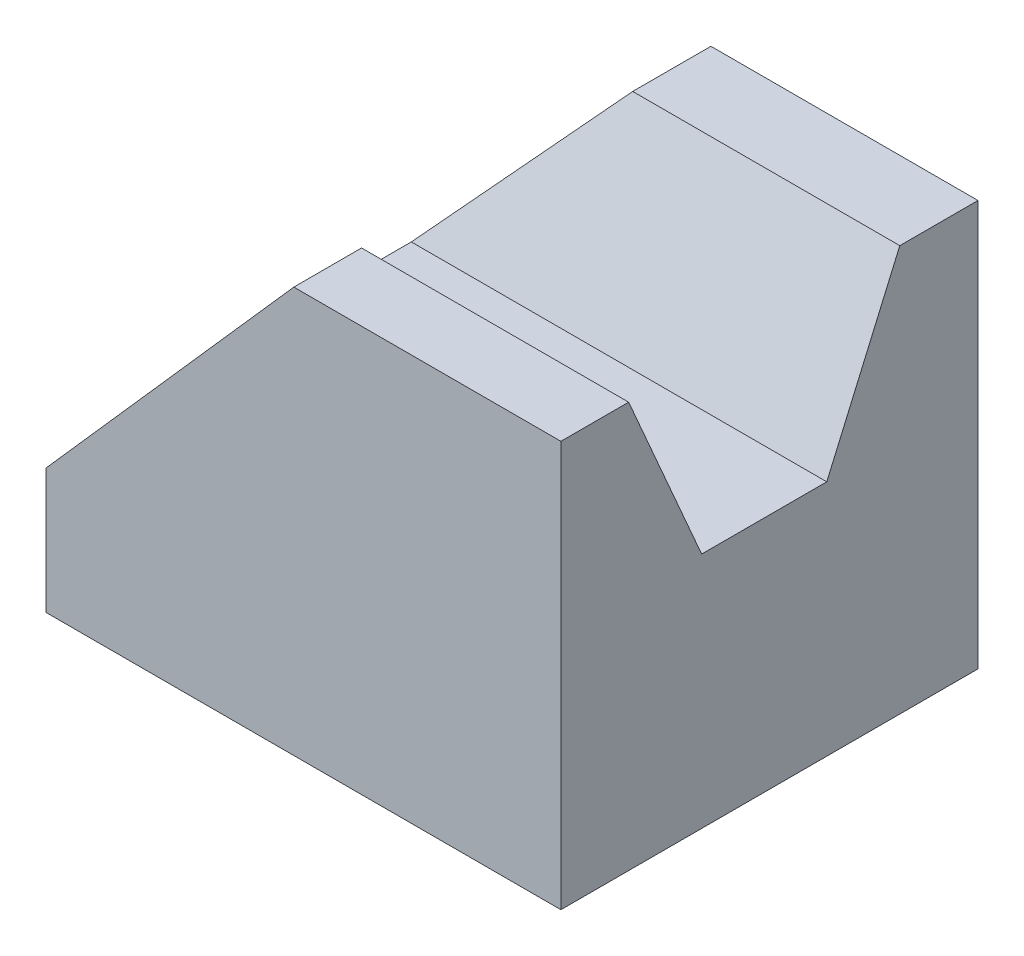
ISO-10303-21;
HEADER;
FILE_DESCRIPTION(('STEP AP214'),'2;1');
FILE_NAME('part.step','',(''),(''),'','','');
FILE_SCHEMA(('AUTOMOTIVE_DESIGN { 1 0 10303 214 1 1 1 1 }'));
ENDSEC;
DATA;
#1=APPLICATION_CONTEXT('core data for automotive mechanical design processes');
#2=APPLICATION_PROTOCOL_DEFINITION('international standard','automotive_design',2000,#1);
#3=PRODUCT_CONTEXT('',#1,'mechanical');
#4=PRODUCT('Part','Part','',(#3));
#5=PRODUCT_RELATED_PRODUCT_CATEGORY('part','',(#4));
#6=PRODUCT_DEFINITION_FORMATION('','',#4);
#7=PRODUCT_DEFINITION_CONTEXT('part definition',#1,'design');
#8=PRODUCT_DEFINITION('design','',#6,#7);
#9=PRODUCT_DEFINITION_SHAPE('','',#8);
#10=(LENGTH_UNIT() NAMED_UNIT(*) SI_UNIT(.MILLI.,.METRE.));
#11=(NAMED_UNIT(*) PLANE_ANGLE_UNIT() SI_UNIT($,.RADIAN.));
#12=(NAMED_UNIT(*) SI_UNIT($,.STERADIAN.) SOLID_ANGLE_UNIT());
#13=UNCERTAINTY_MEASURE_WITH_UNIT(LENGTH_MEASURE(1.E-05),#10,'distance_accuracy_value','');
#14=(GEOMETRIC_REPRESENTATION_CONTEXT(3) GLOBAL_UNCERTAINTY_ASSIGNED_CONTEXT((#13)) GLOBAL_UNIT_ASSIGNED_CONTEXT((#10,
#11,#12)) REPRESENTATION_CONTEXT('',''));
#15=CARTESIAN_POINT('',(0.,0.,0.));
#16=DIRECTION('',(0.,0.,1.));
#17=DIRECTION('',(1.,0.,0.));
#18=AXIS2_PLACEMENT_3D('',#15,#16,#17);
#19=CARTESIAN_POINT('',(-24.6885610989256,19.451788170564,40.));
#20=DIRECTION('',(0.,-1.,0.));
#21=DIRECTION('',(0.,0.,-1.));
#22=AXIS2_PLACEMENT_3D('',#19,#20,#21);
#23=PLANE('',#22);
#24=DIRECTION('',(-1.,0.,0.));
#25=VECTOR('',#24,1.);
#26=CARTESIAN_POINT('',(24.6885610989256,19.451788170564,33.5014972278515));
#27=LINE('',#26,#25);
#28=CARTESIAN_POINT('',(24.6885610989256,19.451788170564,33.5014972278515));
#29=VERTEX_POINT('',#28);
#30=CARTESIAN_POINT('',(-0.924713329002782,19.451788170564,33.5014972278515));
#31=VERTEX_POINT('',#30);
#32=EDGE_CURVE('E101',#29,#31,#27,.T.);
#33=ORIENTED_EDGE('',*,*,#32,.T.);
#34=DIRECTION('',(0.,0.,-1.));
#35=VECTOR('',#34,1.);
#36=CARTESIAN_POINT('',(-0.924713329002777,19.451788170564,40.));
#37=LINE('',#36,#35);
#38=CARTESIAN_POINT('',(-0.924713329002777,19.451788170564,40.));
#39=VERTEX_POINT('',#38);
#40=EDGE_CURVE('E146',#39,#31,#37,.T.);
#41=ORIENTED_EDGE('',*,*,#40,.F.);
#42=DIRECTION('',(-1.,0.,0.));
#43=VECTOR('',#42,1.);
#44=CARTESIAN_POINT('',(-24.6885610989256,19.451788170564,40.));
#45=LINE('',#44,#43);
#46=CARTESIAN_POINT('',(24.6885610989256,19.451788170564,40.));
#47=VERTEX_POINT('',#46);
#48=EDGE_CURVE('E123',#47,#39,#45,.T.);
#49=ORIENTED_EDGE('',*,*,#48,.F.);
#50=DIRECTION('',(0.,0.,-1.));
#51=VECTOR('',#50,1.);
#52=CARTESIAN_POINT('',(24.6885610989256,19.451788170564,40.));
#53=LINE('',#52,#51);
#54=EDGE_CURVE('E118',#47,#29,#53,.T.);
#55=ORIENTED_EDGE('',*,*,#54,.T.);
#56=EDGE_LOOP('',(#33,#41,#49,#55));
#57=FACE_BOUND('',#56,.T.);
#58=ADVANCED_FACE('F31',(#57),#23,.F.);
#59=DIRECTION('',(-1.,0.,0.));
#60=VECTOR('',#59,1.);
#61=CARTESIAN_POINT('',(24.6885610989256,19.451788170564,7.50149722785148));
#62=LINE('',#61,#60);
#63=CARTESIAN_POINT('',(24.6885610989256,19.451788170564,7.50149722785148));
#64=VERTEX_POINT('',#63);
#65=CARTESIAN_POINT('',(-0.924713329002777,19.451788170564,7.50149722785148));
#66=VERTEX_POINT('',#65);
#67=EDGE_CURVE('E46',#64,#66,#62,.T.);
#68=ORIENTED_EDGE('',*,*,#67,.F.);
#69=CARTESIAN_POINT('',(24.6885610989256,19.451788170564,0.));
#70=VERTEX_POINT('',#69);
#71=EDGE_CURVE('E126',#64,#70,#53,.T.);
#72=ORIENTED_EDGE('',*,*,#71,.T.);
#73=DIRECTION('',(-1.,0.,0.));
#74=VECTOR('',#73,1.);
#75=CARTESIAN_POINT('',(-24.6885610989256,19.451788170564,0.));
#76=LINE('',#75,#74);
#77=CARTESIAN_POINT('',(-0.924713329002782,19.451788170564,0.));
#78=VERTEX_POINT('',#77);
#79=EDGE_CURVE('E163',#70,#78,#76,.T.);
#80=ORIENTED_EDGE('',*,*,#79,.T.);
#81=EDGE_CURVE('E53',#66,#78,#37,.T.);
#82=ORIENTED_EDGE('',*,*,#81,.F.);
#83=EDGE_LOOP('',(#68,#72,#80,#82));
#84=FACE_BOUND('',#83,.T.);
#85=ADVANCED_FACE('F186',(#84),#23,.F.);
#86=CARTESIAN_POINT('',(24.6885610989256,-19.451788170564,40.));
#87=DIRECTION('',(-1.,0.,0.));
#88=DIRECTION('',(0.,0.,1.));
#89=AXIS2_PLACEMENT_3D('',#86,#87,#88);
#90=PLANE('',#89);
#91=DIRECTION('',(0.,-0.917201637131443,-0.398423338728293));
#92=VECTOR('',#91,1.);
#93=CARTESIAN_POINT('',(24.6885610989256,19.451788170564,33.5014972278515));
#94=LINE('',#93,#92);
#95=CARTESIAN_POINT('',(24.6885610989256,3.33724156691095,26.5014972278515));
#96=VERTEX_POINT('',#95);
#97=EDGE_CURVE('E105',#29,#96,#94,.T.);
#98=ORIENTED_EDGE('',*,*,#97,.F.);
#99=ORIENTED_EDGE('',*,*,#54,.F.);
#100=DIRECTION('',(0.,1.,0.));
#101=VECTOR('',#100,1.);
#102=CARTESIAN_POINT('',(24.6885610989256,-19.451788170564,40.));
#103=LINE('',#102,#101);
#104=CARTESIAN_POINT('',(24.6885610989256,-19.451788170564,40.));
#105=VERTEX_POINT('',#104);
#106=EDGE_CURVE('E152',#105,#47,#103,.T.);
#107=ORIENTED_EDGE('',*,*,#106,.F.);
#108=DIRECTION('',(0.,0.,-1.));
#109=VECTOR('',#108,1.);
#110=CARTESIAN_POINT('',(24.6885610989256,-19.451788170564,40.));
#111=LINE('',#110,#109);
#112=CARTESIAN_POINT('',(24.6885610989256,-19.451788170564,0.));
#113=VERTEX_POINT('',#112);
#114=EDGE_CURVE('E160',#105,#113,#111,.T.);
#115=ORIENTED_EDGE('',*,*,#114,.T.);
#116=DIRECTION('',(0.,1.,0.));
#117=VECTOR('',#116,1.);
#118=CARTESIAN_POINT('',(24.6885610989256,-19.451788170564,0.));
#119=LINE('',#118,#117);
#120=EDGE_CURVE('E151',#113,#70,#119,.T.);
#121=ORIENTED_EDGE('',*,*,#120,.T.);
#122=ORIENTED_EDGE('',*,*,#71,.F.);
#123=DIRECTION('',(0.,0.917201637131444,-0.398423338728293));
#124=VECTOR('',#123,1.);
#125=CARTESIAN_POINT('',(24.6885610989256,3.33724156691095,14.5014972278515));
#126=LINE('',#125,#124);
#127=CARTESIAN_POINT('',(24.6885610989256,3.33724156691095,14.5014972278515));
#128=VERTEX_POINT('',#127);
#129=EDGE_CURVE('E184',#128,#64,#126,.T.);
#130=ORIENTED_EDGE('',*,*,#129,.F.);
#131=DIRECTION('',(0.,0.,-1.));
#132=VECTOR('',#131,1.);
#133=CARTESIAN_POINT('',(24.6885610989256,3.33724156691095,26.5014972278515));
#134=LINE('',#133,#132);
#135=EDGE_CURVE('E120',#96,#128,#134,.T.);
#136=ORIENTED_EDGE('',*,*,#135,.F.);
#137=EDGE_LOOP('',(#98,#99,#107,#115,#121,#122,#130,#136));
#138=FACE_BOUND('',#137,.T.);
#139=ADVANCED_FACE('F33',(#138),#90,.F.);
#140=CARTESIAN_POINT('',(-0.924713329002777,19.451788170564,40.));
#141=DIRECTION('',(-0.749538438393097,0.66196082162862,0.));
#142=DIRECTION('',(-0.66196082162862,-0.749538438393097,0.));
#143=AXIS2_PLACEMENT_3D('',#140,#141,#142);
#144=PLANE('',#143);
#145=ORIENTED_EDGE('',*,*,#40,.T.);
#146=DIRECTION('',(-0.62943765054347,-0.712712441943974,-0.309595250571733));
#147=VECTOR('',#146,1.);
#148=CARTESIAN_POINT('',(0.341655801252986,20.8856983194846,34.1243736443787));
#149=LINE('',#148,#147);
#150=CARTESIAN_POINT('',(-15.156403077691,3.33724156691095,26.5014972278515));
#151=VERTEX_POINT('',#150);
#152=EDGE_CURVE('E11',#31,#151,#149,.T.);
#153=ORIENTED_EDGE('',*,*,#152,.T.);
#154=DIRECTION('',(0.,0.,-1.));
#155=VECTOR('',#154,1.);
#156=CARTESIAN_POINT('',(-15.156403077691,3.33724156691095,40.));
#157=LINE('',#156,#155);
#158=CARTESIAN_POINT('',(-15.156403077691,3.33724156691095,14.5014972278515));
#159=VERTEX_POINT('',#158);
#160=EDGE_CURVE('E39',#151,#159,#157,.T.);
#161=ORIENTED_EDGE('',*,*,#160,.T.);
#162=DIRECTION('',(0.62943765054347,0.712712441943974,-0.309595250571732));
#163=VECTOR('',#162,1.);
#164=CARTESIAN_POINT('',(-7.25772604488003,12.2809159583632,10.6164533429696));
#165=LINE('',#164,#163);
#166=EDGE_CURVE('E125',#159,#66,#165,.T.);
#167=ORIENTED_EDGE('',*,*,#166,.T.);
#168=ORIENTED_EDGE('',*,*,#81,.T.);
#169=DIRECTION('',(0.66196082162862,0.749538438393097,0.));
#170=VECTOR('',#169,1.);
#171=CARTESIAN_POINT('',(-0.924713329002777,19.451788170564,0.));
#172=LINE('',#171,#170);
#173=CARTESIAN_POINT('',(-24.6885610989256,-7.45602384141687,0.));
#174=VERTEX_POINT('',#173);
#175=EDGE_CURVE('E111',#174,#78,#172,.T.);
#176=ORIENTED_EDGE('',*,*,#175,.F.);
#177=DIRECTION('',(0.,0.,-1.));
#178=VECTOR('',#177,1.);
#179=CARTESIAN_POINT('',(-24.6885610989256,-7.45602384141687,40.));
#180=LINE('',#179,#178);
#181=CARTESIAN_POINT('',(-24.6885610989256,-7.45602384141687,40.));
#182=VERTEX_POINT('',#181);
#183=EDGE_CURVE('E148',#182,#174,#180,.T.);
#184=ORIENTED_EDGE('',*,*,#183,.F.);
#185=DIRECTION('',(0.66196082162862,0.749538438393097,0.));
#186=VECTOR('',#185,1.);
#187=CARTESIAN_POINT('',(-0.924713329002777,19.451788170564,40.));
#188=LINE('',#187,#186);
#189=EDGE_CURVE('E143',#182,#39,#188,.T.);
#190=ORIENTED_EDGE('',*,*,#189,.T.);
#191=EDGE_LOOP('',(#145,#153,#161,#167,#168,#176,#184,#190));
#192=FACE_BOUND('',#191,.T.);
#193=ADVANCED_FACE('F133',(#192),#144,.T.);
#194=CARTESIAN_POINT('',(-24.6885610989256,-19.451788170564,40.));
#195=DIRECTION('',(1.,0.,0.));
#196=DIRECTION('',(0.,0.,-1.));
#197=AXIS2_PLACEMENT_3D('',#194,#195,#196);
#198=PLANE('',#197);
#199=ORIENTED_EDGE('',*,*,#183,.T.);
#200=DIRECTION('',(0.,-1.,0.));
#201=VECTOR('',#200,1.);
#202=CARTESIAN_POINT('',(-24.6885610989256,-19.451788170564,0.));
#203=LINE('',#202,#201);
#204=CARTESIAN_POINT('',(-24.6885610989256,-19.451788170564,0.));
#205=VERTEX_POINT('',#204);
#206=EDGE_CURVE('E166',#174,#205,#203,.T.);
#207=ORIENTED_EDGE('',*,*,#206,.T.);
#208=DIRECTION('',(0.,0.,-1.));
#209=VECTOR('',#208,1.);
#210=CARTESIAN_POINT('',(-24.6885610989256,-19.451788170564,40.));
#211=LINE('',#210,#209);
#212=CARTESIAN_POINT('',(-24.6885610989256,-19.451788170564,40.));
#213=VERTEX_POINT('',#212);
#214=EDGE_CURVE('E129',#213,#205,#211,.T.);
#215=ORIENTED_EDGE('',*,*,#214,.F.);
#216=DIRECTION('',(0.,-1.,0.));
#217=VECTOR('',#216,1.);
#218=CARTESIAN_POINT('',(-24.6885610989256,-19.451788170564,40.));
#219=LINE('',#218,#217);
#220=EDGE_CURVE('E156',#182,#213,#219,.T.);
#221=ORIENTED_EDGE('',*,*,#220,.F.);
#222=EDGE_LOOP('',(#199,#207,#215,#221));
#223=FACE_BOUND('',#222,.T.);
#224=ADVANCED_FACE('F201',(#223),#198,.F.);
#225=CARTESIAN_POINT('',(24.6885610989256,19.451788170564,40.));
#226=DIRECTION('',(0.,0.,-1.));
#227=DIRECTION('',(-1.,0.,0.));
#228=AXIS2_PLACEMENT_3D('',#225,#226,#227);
#229=PLANE('',#228);
#230=ORIENTED_EDGE('',*,*,#189,.F.);
#231=ORIENTED_EDGE('',*,*,#220,.T.);
#232=DIRECTION('',(1.,0.,0.));
#233=VECTOR('',#232,1.);
#234=CARTESIAN_POINT('',(-24.6885610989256,-19.451788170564,40.));
#235=LINE('',#234,#233);
#236=EDGE_CURVE('E158',#213,#105,#235,.T.);
#237=ORIENTED_EDGE('',*,*,#236,.T.);
#238=ORIENTED_EDGE('',*,*,#106,.T.);
#239=ORIENTED_EDGE('',*,*,#48,.T.);
#240=EDGE_LOOP('',(#230,#231,#237,#238,#239));
#241=FACE_BOUND('',#240,.T.);
#242=ADVANCED_FACE('F204',(#241),#229,.F.);
#243=CARTESIAN_POINT('',(24.6885610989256,19.451788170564,0.));
#244=DIRECTION('',(0.,0.,-1.));
#245=DIRECTION('',(-1.,0.,0.));
#246=AXIS2_PLACEMENT_3D('',#243,#244,#245);
#247=PLANE('',#246);
#248=ORIENTED_EDGE('',*,*,#206,.F.);
#249=ORIENTED_EDGE('',*,*,#175,.T.);
#250=ORIENTED_EDGE('',*,*,#79,.F.);
#251=ORIENTED_EDGE('',*,*,#120,.F.);
#252=DIRECTION('',(1.,0.,0.));
#253=VECTOR('',#252,1.);
#254=CARTESIAN_POINT('',(-24.6885610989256,-19.451788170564,0.));
#255=LINE('',#254,#253);
#256=EDGE_CURVE('E154',#205,#113,#255,.T.);
#257=ORIENTED_EDGE('',*,*,#256,.F.);
#258=EDGE_LOOP('',(#248,#249,#250,#251,#257));
#259=FACE_BOUND('',#258,.T.);
#260=ADVANCED_FACE('F181',(#259),#247,.T.);
#261=CARTESIAN_POINT('',(-24.6885610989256,-19.451788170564,40.));
#262=DIRECTION('',(0.,1.,0.));
#263=DIRECTION('',(0.,0.,1.));
#264=AXIS2_PLACEMENT_3D('',#261,#262,#263);
#265=PLANE('',#264);
#266=ORIENTED_EDGE('',*,*,#256,.T.);
#267=ORIENTED_EDGE('',*,*,#114,.F.);
#268=ORIENTED_EDGE('',*,*,#236,.F.);
#269=ORIENTED_EDGE('',*,*,#214,.T.);
#270=EDGE_LOOP('',(#266,#267,#268,#269));
#271=FACE_BOUND('',#270,.T.);
#272=ADVANCED_FACE('F176',(#271),#265,.F.);
#273=CARTESIAN_POINT('',(24.6885610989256,19.451788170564,33.5014972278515));
#274=DIRECTION('',(0.,0.398423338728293,-0.917201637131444));
#275=DIRECTION('',(0.,0.917201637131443,0.398423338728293));
#276=AXIS2_PLACEMENT_3D('',#273,#274,#275);
#277=PLANE('',#276);
#278=ORIENTED_EDGE('',*,*,#32,.F.);
#279=ORIENTED_EDGE('',*,*,#97,.T.);
#280=DIRECTION('',(-1.,0.,0.));
#281=VECTOR('',#280,1.);
#282=CARTESIAN_POINT('',(24.6885610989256,3.33724156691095,26.5014972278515));
#283=LINE('',#282,#281);
#284=EDGE_CURVE('E112',#96,#151,#283,.T.);
#285=ORIENTED_EDGE('',*,*,#284,.T.);
#286=ORIENTED_EDGE('',*,*,#152,.F.);
#287=EDGE_LOOP('',(#278,#279,#285,#286));
#288=FACE_BOUND('',#287,.T.);
#289=ADVANCED_FACE('F103',(#288),#277,.T.);
#290=CARTESIAN_POINT('',(24.6885610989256,3.33724156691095,26.5014972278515));
#291=DIRECTION('',(0.,1.,0.));
#292=DIRECTION('',(0.,0.,1.));
#293=AXIS2_PLACEMENT_3D('',#290,#291,#292);
#294=PLANE('',#293);
#295=ORIENTED_EDGE('',*,*,#284,.F.);
#296=ORIENTED_EDGE('',*,*,#135,.T.);
#297=DIRECTION('',(-1.,0.,0.));
#298=VECTOR('',#297,1.);
#299=CARTESIAN_POINT('',(24.6885610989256,3.33724156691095,14.5014972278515));
#300=LINE('',#299,#298);
#301=EDGE_CURVE('E138',#128,#159,#300,.T.);
#302=ORIENTED_EDGE('',*,*,#301,.T.);
#303=ORIENTED_EDGE('',*,*,#160,.F.);
#304=EDGE_LOOP('',(#295,#296,#302,#303));
#305=FACE_BOUND('',#304,.T.);
#306=ADVANCED_FACE('F136',(#305),#294,.T.);
#307=CARTESIAN_POINT('',(24.6885610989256,3.33724156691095,14.5014972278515));
#308=DIRECTION('',(0.,0.398423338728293,0.917201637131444));
#309=DIRECTION('',(0.,-0.917201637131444,0.398423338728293));
#310=AXIS2_PLACEMENT_3D('',#307,#308,#309);
#311=PLANE('',#310);
#312=ORIENTED_EDGE('',*,*,#301,.F.);
#313=ORIENTED_EDGE('',*,*,#129,.T.);
#314=ORIENTED_EDGE('',*,*,#67,.T.);
#315=ORIENTED_EDGE('',*,*,#166,.F.);
#316=EDGE_LOOP('',(#312,#313,#314,#315));
#317=FACE_BOUND('',#316,.T.);
#318=ADVANCED_FACE('F189',(#317),#311,.T.);
#319=CLOSED_SHELL('',(#58,#85,#139,#193,#224,#242,#260,#272,#289,#306,#318));
#320=MANIFOLD_SOLID_BREP('B2',#319);
#321=ADVANCED_BREP_SHAPE_REPRESENTATION('',(#18,#320),#14);
#322=SHAPE_DEFINITION_REPRESENTATION(#9,#321);
ENDSEC;
END-ISO-10303-21;
